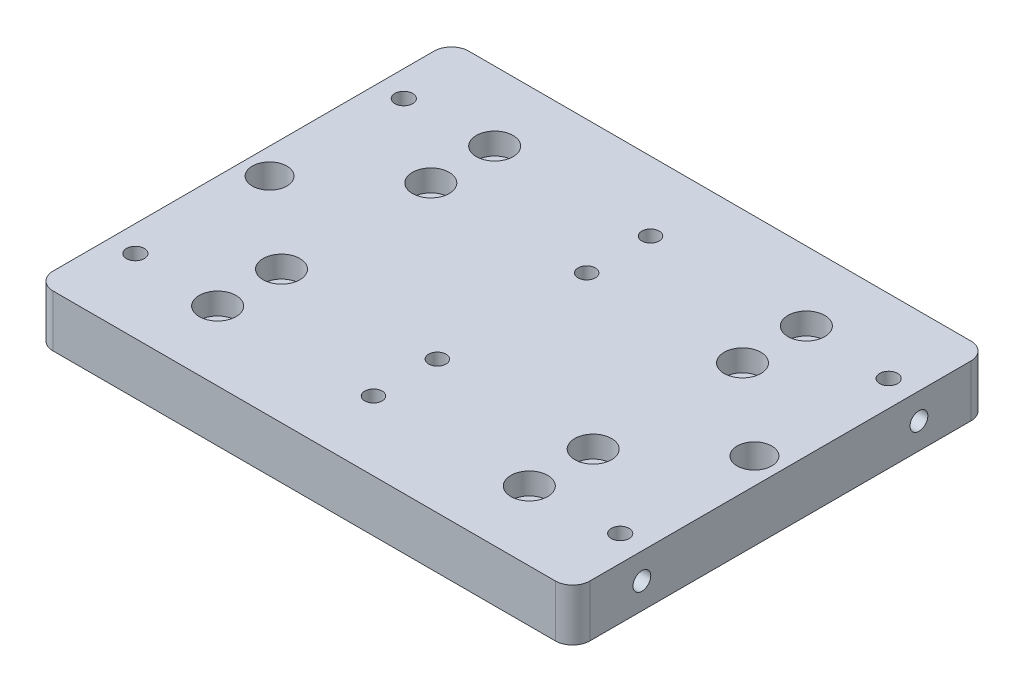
from build123d import *

# Parameters (mm, degrees)
SKETCH1_W                                         = 196.85
SKETCH1_H                                         = 152.4
BOSS_EXTRUDE1_DEPTH                               = 19.05
CBORE_FOR_5_16_SOCKET_HEAD_CAP_SCREW2_D           = 8.4328
CBORE_FOR_5_16_SOCKET_HEAD_CAP_SCREW2_CBORE_D     = 13.49502
CBORE_FOR_5_16_SOCKET_HEAD_CAP_SCREW2_CBORE_DEPTH = 7.9375
F_1_4_0_2500_DOWEL_HOLE1_D                        = 6.35
F_5_16_18_TAPPED_HOLE2_D                          = 6.5278
F_1_2_0_5000_DOWEL_HOLE1_D                        = 12.7
CBORE_FOR_5_16_SOCKET_HEAD_CAP_SCREW1_D           = 8.4328
CBORE_FOR_5_16_SOCKET_HEAD_CAP_SCREW1_CBORE_D     = 13.49502
CBORE_FOR_5_16_SOCKET_HEAD_CAP_SCREW1_CBORE_DEPTH = 7.9375
F_1_4_0_2500_DOWEL_HOLE2_D                        = 6.35
F_5_16_18_TAPPED_HOLE1_AT_2_COUNT                 = 2
F_5_16_18_TAPPED_HOLE1_AT_2_PITCH                 = 101.6
FILLET1_R                                         = 6.35


with BuildPart() as part:
    # Sketch1 → Boss-Extrude1 (new body)
    with BuildSketch(Plane(origin=(0, 0, 0), x_dir=(1, 0, 0), z_dir=(0, 1, 0))):
        Rectangle(SKETCH1_W, SKETCH1_H)
    extrude(amount=BOSS_EXTRUDE1_DEPTH)

    # CBORE for 5_16 Socket Head Cap Screw2 (through all)
    with Locations(Plane(origin=(0, 19.05, 0), x_dir=(1, 0, 0), z_dir=(0, 1, 0))):
        with Locations((-57.15, 27.3812), (57.15, 27.3812), (57.15, -27.3812), (-57.15, -27.3812)):
            CounterBoreHole(CBORE_FOR_5_16_SOCKET_HEAD_CAP_SCREW2_D / 2, CBORE_FOR_5_16_SOCKET_HEAD_CAP_SCREW2_CBORE_D / 2, CBORE_FOR_5_16_SOCKET_HEAD_CAP_SCREW2_CBORE_DEPTH)

    # 1_4 _0.2500_ Dowel Hole1 (through all)
    with Locations(Plane(origin=(0, 19.05, 0), x_dir=(1, 0, 0), z_dir=(0, 1, 0))):
        with Locations((0, -27.3812), (0, 27.3812)):
            Hole(F_1_4_0_2500_DOWEL_HOLE1_D / 2)

    # 5_16-18 Tapped Hole2 (through all)
    with Locations(Plane(origin=(0, 19.05, 0), x_dir=(1, 0, 0), z_dir=(0, 1, 0))):
        with Locations((-88.9, 49.2125), (-88.9, -49.2125), (88.9, -49.2125), (88.9, 49.2125)):
            Hole(F_5_16_18_TAPPED_HOLE2_D / 2)

    # 1_2 _0.5000_ Dowel Hole1 (through all)
    with Locations(Plane(origin=(0, 19.05, 0), x_dir=(1, 0, 0), z_dir=(0, 1, 0))):
        with Locations((-88.9, 0), (88.9, 0)):
            Hole(F_1_2_0_5000_DOWEL_HOLE1_D / 2)

    # CBORE for 5_16 Socket Head Cap Screw1 (through all)
    with Locations(Plane(origin=(0, 19.05, 0), x_dir=(1, 0, 0), z_dir=(0, 1, 0))):
        with Locations((57.15, 50.8), (-57.15, 50.8), (-57.15, -50.8), (57.15, -50.8)):
            CounterBoreHole(CBORE_FOR_5_16_SOCKET_HEAD_CAP_SCREW1_D / 2, CBORE_FOR_5_16_SOCKET_HEAD_CAP_SCREW1_CBORE_D / 2, CBORE_FOR_5_16_SOCKET_HEAD_CAP_SCREW1_CBORE_DEPTH)

    # 1_4 _0.2500_ Dowel Hole2 (through all)
    with Locations(Plane(origin=(0, 0, 0), x_dir=(-1, 0, 0), z_dir=(0, -1, 0))):
        with Locations((0, 50.8), (0, -50.8)):
            Hole(F_1_4_0_2500_DOWEL_HOLE2_D / 2)

    # Sketch16 → 5_16-18 Tapped Hole1 (revolve, cut)
    with BuildSketch(Plane(origin=(-98.425, 9.525, 50.8), x_dir=(0, 0, 1), z_dir=(0, 1, 0))):
        Polygon((0, 0), (0, 17.963148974), (3.2639, 16.002), (3.2639, 0), align=None)
    f_5_16_18_tapped_hole1 = revolve(axis=Axis((-104.775, 9.525, 50.8), (1, 0, 0)), mode=Mode.SUBTRACT)

    # 5_16-18 Tapped Hole1 at 2: 5_16-18 Tapped Hole1 ×2
    with Locations(*[(0, 0, -i * F_5_16_18_TAPPED_HOLE1_AT_2_PITCH) for i in range(1, F_5_16_18_TAPPED_HOLE1_AT_2_COUNT)]):
        add(f_5_16_18_tapped_hole1, mode=Mode.SUBTRACT)

    # Fillet1
    fillet1_edges = [part.edges().sort_by_distance(p)[0] for p in [
        (98.425, 9.525, 76.2),
        (-98.425, 9.525, 76.2),
        (-98.425, 9.525, -76.2),
        (98.425, 9.525, -76.2),
    ]]
    fillet(fillet1_edges, radius=FILLET1_R)

    # Mirror1: 5_16-18 Tapped Hole1 across plane
    add(f_5_16_18_tapped_hole1.mirror(Plane(origin=(0, 0, 0), x_dir=(0, 0, 1), z_dir=(1, 0, 0))), mode=Mode.SUBTRACT)

    # Mirror1 copy 1 sketch → Mirror1 copy 1 (revolve, cut)
    with BuildSketch(Plane(origin=(98.425, 9.525, -50.8), x_dir=(0, 0, 1), z_dir=(0, 1, 0))):
        Polygon((0, 0), (0, -17.963148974), (3.2639, -16.002), (3.2639, 0), align=None)
    revolve(axis=Axis((104.775, 9.525, -50.8), (1, 0, 0)), mode=Mode.SUBTRACT)


solid = part.part
